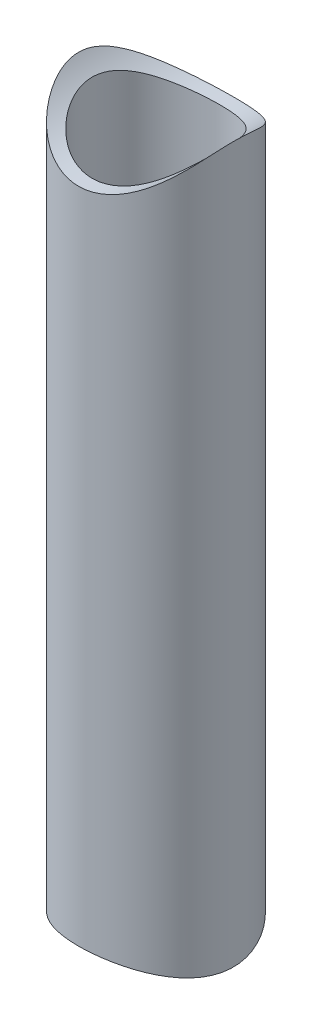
ISO-10303-21;
HEADER;
FILE_DESCRIPTION(('STEP AP214'),'2;1');
FILE_NAME('part.step','',(''),(''),'','','');
FILE_SCHEMA(('AUTOMOTIVE_DESIGN { 1 0 10303 214 1 1 1 1 }'));
ENDSEC;
DATA;
#1=APPLICATION_CONTEXT('core data for automotive mechanical design processes');
#2=APPLICATION_PROTOCOL_DEFINITION('international standard','automotive_design',2000,#1);
#3=PRODUCT_CONTEXT('',#1,'mechanical');
#4=PRODUCT('Part','Part','',(#3));
#5=PRODUCT_RELATED_PRODUCT_CATEGORY('part','',(#4));
#6=PRODUCT_DEFINITION_FORMATION('','',#4);
#7=PRODUCT_DEFINITION_CONTEXT('part definition',#1,'design');
#8=PRODUCT_DEFINITION('design','',#6,#7);
#9=PRODUCT_DEFINITION_SHAPE('','',#8);
#10=(LENGTH_UNIT() NAMED_UNIT(*) SI_UNIT(.MILLI.,.METRE.));
#11=(NAMED_UNIT(*) PLANE_ANGLE_UNIT() SI_UNIT($,.RADIAN.));
#12=(NAMED_UNIT(*) SI_UNIT($,.STERADIAN.) SOLID_ANGLE_UNIT());
#13=UNCERTAINTY_MEASURE_WITH_UNIT(LENGTH_MEASURE(1.E-05),#10,'distance_accuracy_value','');
#14=(GEOMETRIC_REPRESENTATION_CONTEXT(3) GLOBAL_UNCERTAINTY_ASSIGNED_CONTEXT((#13)) GLOBAL_UNIT_ASSIGNED_CONTEXT((#10,
#11,#12)) REPRESENTATION_CONTEXT('',''));
#15=CARTESIAN_POINT('',(0.,0.,0.));
#16=DIRECTION('',(0.,0.,1.));
#17=DIRECTION('',(1.,0.,0.));
#18=AXIS2_PLACEMENT_3D('',#15,#16,#17);
#19=CARTESIAN_POINT('',(0.,-152.4,0.));
#20=DIRECTION('',(0.,1.,0.));
#21=DIRECTION('',(0.,0.,1.));
#22=AXIS2_PLACEMENT_3D('',#19,#20,#21);
#23=CYLINDRICAL_SURFACE('',#22,12.7);
#24=CARTESIAN_POINT('',(0.,-123.825,12.7));
#25=CARTESIAN_POINT('',(-0.338275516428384,-123.825002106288,12.6999974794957));
#26=CARTESIAN_POINT('',(-0.676637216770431,-123.831022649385,12.6864669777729));
#27=CARTESIAN_POINT('',(-1.3509250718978,-123.854955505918,12.6324783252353));
#28=CARTESIAN_POINT('',(-1.68684972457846,-123.872874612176,12.5920047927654));
#29=CARTESIAN_POINT('',(-2.35434059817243,-123.920184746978,12.484453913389));
#30=CARTESIAN_POINT('',(-2.68589590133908,-123.949600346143,12.4173195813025));
#31=CARTESIAN_POINT('',(-3.34148510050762,-124.019130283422,12.2571749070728));
#32=CARTESIAN_POINT('',(-3.66552002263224,-124.059243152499,12.1641681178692));
#33=CARTESIAN_POINT('',(-4.30282306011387,-124.148990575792,11.9535745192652));
#34=CARTESIAN_POINT('',(-4.61612547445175,-124.198590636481,11.8360766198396));
#35=CARTESIAN_POINT('',(-5.23127441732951,-124.306194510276,11.5773536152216));
#36=CARTESIAN_POINT('',(-5.53312058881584,-124.364198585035,11.4361277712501));
#37=CARTESIAN_POINT('',(-6.12351543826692,-124.487205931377,11.1311679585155));
#38=CARTESIAN_POINT('',(-6.41207078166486,-124.552205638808,10.9674454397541));
#39=CARTESIAN_POINT('',(-6.97467687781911,-124.687759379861,10.6185450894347));
#40=CARTESIAN_POINT('',(-7.24872188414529,-124.758315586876,10.4333588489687));
#41=CARTESIAN_POINT('',(-7.79434869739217,-124.907042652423,10.032864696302));
#42=CARTESIAN_POINT('',(-8.06510430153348,-124.985418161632,9.8165068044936));
#43=CARTESIAN_POINT('',(-8.58765375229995,-125.144588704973,9.36279582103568));
#44=CARTESIAN_POINT('',(-8.83944677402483,-125.225383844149,9.12544181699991));
#45=CARTESIAN_POINT('',(-9.322896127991,-125.387423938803,8.63094577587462));
#46=CARTESIAN_POINT('',(-9.55454267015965,-125.46866909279,8.37379423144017));
#47=CARTESIAN_POINT('',(-9.99634947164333,-125.629514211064,7.84109449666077));
#48=CARTESIAN_POINT('',(-10.2065060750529,-125.70911389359,7.56554318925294));
#49=CARTESIAN_POINT('',(-10.6155907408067,-125.869058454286,6.98095767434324));
#50=CARTESIAN_POINT('',(-10.8131595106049,-125.949178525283,6.67090836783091));
#51=CARTESIAN_POINT('',(-11.1812213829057,-126.10264890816,6.03370532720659));
#52=CARTESIAN_POINT('',(-11.3517257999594,-126.176002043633,5.70655881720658));
#53=CARTESIAN_POINT('',(-11.6642112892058,-126.313490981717,5.03712025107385));
#54=CARTESIAN_POINT('',(-11.8061986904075,-126.37762882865,4.69483157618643));
#55=CARTESIAN_POINT('',(-12.0602022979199,-126.494369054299,3.99740081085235));
#56=CARTESIAN_POINT('',(-12.1722210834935,-126.546972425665,3.64225982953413));
#57=CARTESIAN_POINT('',(-12.3598745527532,-126.636181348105,2.94079929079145));
#58=CARTESIAN_POINT('',(-12.4371121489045,-126.673482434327,2.59499720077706));
#59=CARTESIAN_POINT('',(-12.5625324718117,-126.734492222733,1.8969699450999));
#60=CARTESIAN_POINT('',(-12.6107162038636,-126.758201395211,1.54474500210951));
#61=CARTESIAN_POINT('',(-12.6773679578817,-126.791088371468,0.837018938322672));
#62=CARTESIAN_POINT('',(-12.6958529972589,-126.800274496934,0.481519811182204));
#63=CARTESIAN_POINT('',(-12.7029000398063,-126.803770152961,-0.229837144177));
#64=CARTESIAN_POINT('',(-12.691463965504,-126.798080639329,-0.585694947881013));
#65=CARTESIAN_POINT('',(-12.6412011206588,-126.773230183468,-1.26284174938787));
#66=CARTESIAN_POINT('',(-12.6049216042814,-126.755322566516,-1.58437000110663));
#67=CARTESIAN_POINT('',(-12.508121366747,-126.707969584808,-2.22286951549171));
#68=CARTESIAN_POINT('',(-12.447602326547,-126.678525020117,-2.53984109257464));
#69=CARTESIAN_POINT('',(-12.3029467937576,-126.609021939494,-3.16720001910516));
#70=CARTESIAN_POINT('',(-12.2188063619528,-126.568961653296,-3.47758626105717));
#71=CARTESIAN_POINT('',(-12.0277145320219,-126.479432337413,-4.08985878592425));
#72=CARTESIAN_POINT('',(-11.920762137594,-126.429962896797,-4.3917446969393));
#73=CARTESIAN_POINT('',(-11.6823386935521,-126.321827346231,-4.99194762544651));
#74=CARTESIAN_POINT('',(-11.5503761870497,-126.262981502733,-5.29003675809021));
#75=CARTESIAN_POINT('',(-11.2645427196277,-126.138526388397,-5.87416833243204));
#76=CARTESIAN_POINT('',(-11.1106638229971,-126.072914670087,-6.16020636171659));
#77=CARTESIAN_POINT('',(-10.7820435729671,-125.936632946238,-6.71882166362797));
#78=CARTESIAN_POINT('',(-10.607299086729,-125.865962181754,-6.99139690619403));
#79=CARTESIAN_POINT('',(-10.2379852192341,-125.721289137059,-7.52184264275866));
#80=CARTESIAN_POINT('',(-10.0434145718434,-125.647286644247,-7.77971219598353));
#81=CARTESIAN_POINT('',(-9.61551258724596,-125.490347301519,-8.30405524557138));
#82=CARTESIAN_POINT('',(-9.380251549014,-125.407244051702,-8.56890706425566));
#83=CARTESIAN_POINT('',(-8.88849312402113,-125.241343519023,-9.07798977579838));
#84=CARTESIAN_POINT('',(-8.63200376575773,-125.158546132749,-9.32222839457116));
#85=CARTESIAN_POINT('',(-8.09888464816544,-124.995320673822,-9.78895610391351));
#86=CARTESIAN_POINT('',(-7.82224043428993,-124.914894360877,-10.0114293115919));
#87=CARTESIAN_POINT('',(-7.25057211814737,-124.758589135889,-10.4328931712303));
#88=CARTESIAN_POINT('',(-6.95555553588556,-124.682708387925,-10.6318933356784));
#89=CARTESIAN_POINT('',(-6.33960061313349,-124.535267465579,-11.010632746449));
#90=CARTESIAN_POINT('',(-6.01815123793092,-124.463904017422,-11.189619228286));
#91=CARTESIAN_POINT('',(-5.35940892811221,-124.330081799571,-11.5196547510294));
#92=CARTESIAN_POINT('',(-5.02211549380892,-124.267623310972,-11.670702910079));
#93=CARTESIAN_POINT('',(-4.33421963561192,-124.153466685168,-11.9432546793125));
#94=CARTESIAN_POINT('',(-3.98362407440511,-124.101763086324,-12.0647732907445));
#95=CARTESIAN_POINT('',(-3.27167046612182,-124.010643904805,-12.2769748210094));
#96=CARTESIAN_POINT('',(-2.91031336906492,-123.971227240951,-12.3676604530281));
#97=CARTESIAN_POINT('',(-2.20542331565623,-123.908193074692,-12.5118474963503));
#98=CARTESIAN_POINT('',(-1.86241214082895,-123.883663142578,-12.5675065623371));
#99=CARTESIAN_POINT('',(-1.17232915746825,-123.846968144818,-12.6505493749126));
#100=CARTESIAN_POINT('',(-0.825257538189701,-123.834802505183,-12.6779344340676));
#101=CARTESIAN_POINT('',(-0.129927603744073,-123.823180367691,-12.704099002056));
#102=CARTESIAN_POINT('',(0.218330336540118,-123.823720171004,-12.7028868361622));
#103=CARTESIAN_POINT('',(0.913314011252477,-123.83748494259,-12.6718916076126));
#104=CARTESIAN_POINT('',(1.26003978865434,-123.850709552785,-12.6421093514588));
#105=CARTESIAN_POINT('',(1.92911930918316,-123.88833915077,-12.5568920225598));
#106=CARTESIAN_POINT('',(2.25171701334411,-123.912048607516,-12.5030509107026));
#107=CARTESIAN_POINT('',(2.89089854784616,-123.969799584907,-12.3709014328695));
#108=CARTESIAN_POINT('',(3.2074826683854,-124.003840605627,-12.2925942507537));
#109=CARTESIAN_POINT('',(3.83263444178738,-124.081441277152,-12.1122567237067));
#110=CARTESIAN_POINT('',(4.14120155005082,-124.125001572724,-12.010224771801));
#111=CARTESIAN_POINT('',(4.74846725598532,-124.220624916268,-11.7833413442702));
#112=CARTESIAN_POINT('',(5.04716547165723,-124.272688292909,-11.6584889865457));
#113=CARTESIAN_POINT('',(5.64212359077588,-124.385868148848,-11.3827609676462));
#114=CARTESIAN_POINT('',(5.93802141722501,-124.447215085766,-11.2311990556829));
#115=CARTESIAN_POINT('',(6.51608995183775,-124.576287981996,-10.9059893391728));
#116=CARTESIAN_POINT('',(6.79825565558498,-124.644016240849,-10.7323335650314));
#117=CARTESIAN_POINT('',(7.3474129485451,-124.784307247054,-10.3641130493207));
#118=CARTESIAN_POINT('',(7.61440114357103,-124.856871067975,-10.1695436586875));
#119=CARTESIAN_POINT('',(8.13186805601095,-125.005186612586,-9.76070988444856));
#120=CARTESIAN_POINT('',(8.38234738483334,-125.080938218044,-9.54644623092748));
#121=CARTESIAN_POINT('',(8.88518024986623,-125.240117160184,-9.0813070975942));
#122=CARTESIAN_POINT('',(9.13605373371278,-125.323670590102,-8.8288724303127));
#123=CARTESIAN_POINT('',(9.61582285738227,-125.490316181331,-8.30376088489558));
#124=CARTESIAN_POINT('',(9.84471746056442,-125.573408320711,-8.03108305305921));
#125=CARTESIAN_POINT('',(10.2792401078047,-125.736883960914,-7.46686299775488));
#126=CARTESIAN_POINT('',(10.4848609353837,-125.817266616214,-7.17531496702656));
#127=CARTESIAN_POINT('',(10.8714099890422,-125.972996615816,-6.57494656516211));
#128=CARTESIAN_POINT('',(11.0523353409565,-126.048343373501,-6.26612418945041));
#129=CARTESIAN_POINT('',(11.3920791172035,-126.193395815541,-5.62539933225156));
#130=CARTESIAN_POINT('',(11.5502686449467,-126.262924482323,-5.29312240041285));
#131=CARTESIAN_POINT('',(11.8377196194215,-126.391850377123,-4.61455164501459));
#132=CARTESIAN_POINT('',(11.9669946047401,-126.451252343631,-4.2682644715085));
#133=CARTESIAN_POINT('',(12.1952202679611,-126.557726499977,-3.56419188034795));
#134=CARTESIAN_POINT('',(12.2941882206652,-126.604805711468,-3.20641314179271));
#135=CARTESIAN_POINT('',(12.4606355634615,-126.684795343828,-2.48205760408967));
#136=CARTESIAN_POINT('',(12.5281185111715,-126.717707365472,-2.11548180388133));
#137=CARTESIAN_POINT('',(12.6263100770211,-126.765850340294,-1.40811261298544));
#138=CARTESIAN_POINT('',(12.6596516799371,-126.78234387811,-1.06776863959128));
#139=CARTESIAN_POINT('',(12.6987614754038,-126.801707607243,-0.385118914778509));
#140=CARTESIAN_POINT('',(12.7045312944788,-126.804578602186,-0.0428132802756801));
#141=CARTESIAN_POINT('',(12.6884258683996,-126.796591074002,0.640915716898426));
#142=CARTESIAN_POINT('',(12.6665558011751,-126.785735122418,0.982339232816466));
#143=CARTESIAN_POINT('',(12.5954601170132,-126.750700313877,1.66162592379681));
#144=CARTESIAN_POINT('',(12.5462349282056,-126.72652166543,1.99948915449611));
#145=CARTESIAN_POINT('',(12.4248256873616,-126.667557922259,2.64879578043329));
#146=CARTESIAN_POINT('',(12.3542103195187,-126.633502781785,2.96060116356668));
#147=CARTESIAN_POINT('',(12.1900455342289,-126.555432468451,3.57694459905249));
#148=CARTESIAN_POINT('',(12.0964882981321,-126.511413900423,3.88148013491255));
#149=CARTESIAN_POINT('',(11.887291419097,-126.414692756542,4.48143266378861));
#150=CARTESIAN_POINT('',(11.771651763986,-126.361990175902,4.77684965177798));
#151=CARTESIAN_POINT('',(11.5191985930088,-126.249325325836,5.35706813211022));
#152=CARTESIAN_POINT('',(11.382383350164,-126.189362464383,5.64186875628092));
#153=CARTESIAN_POINT('',(11.0791108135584,-126.05967290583,6.21737604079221));
#154=CARTESIAN_POINT('',(10.9113162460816,-125.989566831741,6.50729268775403));
#155=CARTESIAN_POINT('',(10.5539646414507,-125.844744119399,7.07216666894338));
#156=CARTESIAN_POINT('',(10.3644069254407,-125.77002733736,7.34712353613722));
#157=CARTESIAN_POINT('',(9.96458916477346,-125.617854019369,7.88087429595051));
#158=CARTESIAN_POINT('',(9.75432293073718,-125.540396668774,8.13966331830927));
#159=CARTESIAN_POINT('',(9.31422118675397,-125.384626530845,8.63980703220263));
#160=CARTESIAN_POINT('',(9.08438294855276,-125.306313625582,8.88115928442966));
#161=CARTESIAN_POINT('',(8.5852807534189,-125.143838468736,9.36558938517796));
#162=CARTESIAN_POINT('',(8.31432695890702,-125.059765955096,9.60696020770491));
#163=CARTESIAN_POINT('',(7.75222207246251,-124.895102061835,10.0660162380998));
#164=CARTESIAN_POINT('',(7.46107797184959,-124.81450949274,10.2837095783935));
#165=CARTESIAN_POINT('',(6.85992532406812,-124.658902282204,10.6941088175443));
#166=CARTESIAN_POINT('',(6.54990307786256,-124.583891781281,10.8867962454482));
#167=CARTESIAN_POINT('',(5.91306841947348,-124.441590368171,11.2454052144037));
#168=CARTESIAN_POINT('',(5.5862572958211,-124.374298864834,11.4113288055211));
#169=CARTESIAN_POINT('',(4.92173118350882,-124.250041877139,11.7131646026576));
#170=CARTESIAN_POINT('',(4.58418075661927,-124.192968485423,11.8493942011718));
#171=CARTESIAN_POINT('',(3.89704116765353,-124.089853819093,12.0928044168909));
#172=CARTESIAN_POINT('',(3.54745011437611,-124.043814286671,12.1999804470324));
#173=CARTESIAN_POINT('',(2.83996412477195,-123.964254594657,12.38377313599));
#174=CARTESIAN_POINT('',(2.48209445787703,-123.930700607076,12.4604724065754));
#175=CARTESIAN_POINT('',(1.76026492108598,-123.876976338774,12.5827379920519));
#176=CARTESIAN_POINT('',(1.39630946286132,-123.856796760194,12.6283259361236));
#177=CARTESIAN_POINT('',(0.859545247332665,-123.83741437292,12.6720476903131));
#178=CARTESIAN_POINT('',(0.687846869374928,-123.832762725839,12.6825256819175));
#179=CARTESIAN_POINT('',(0.344106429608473,-123.826554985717,12.6965025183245));
#180=CARTESIAN_POINT('',(0.172064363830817,-123.824998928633,12.7000012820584));
#181=CARTESIAN_POINT('',(0.,-123.825,12.7));
#182=B_SPLINE_CURVE_WITH_KNOTS('',3,(#24,#25,#26,#27,#28,#29,#30,#31,#32,#33,#34,#35,#36,#37,
#38,#39,#40,#41,#42,#43,#44,#45,#46,#47,#48,#49,#50,#51,#52,#53,#54,#55,#56,#57,#58,#59,#60,#61,
#62,#63,#64,#65,#66,#67,#68,#69,#70,#71,#72,#73,#74,#75,#76,#77,#78,#79,#80,#81,#82,#83,#84,#85,
#86,#87,#88,#89,#90,#91,#92,#93,#94,#95,#96,#97,#98,#99,#100,#101,#102,#103,#104,#105,#106,#107,
#108,#109,#110,#111,#112,#113,#114,#115,#116,#117,#118,#119,#120,#121,#122,#123,#124,#125,#126,
#127,#128,#129,#130,#131,#132,#133,#134,#135,#136,#137,#138,#139,#140,#141,#142,#143,#144,#145,
#146,#147,#148,#149,#150,#151,#152,#153,#154,#155,#156,#157,#158,#159,#160,#161,#162,#163,#164,
#165,#166,#167,#168,#169,#170,#171,#172,#173,#174,#175,#176,#177,#178,#179,#180,#181),
.UNSPECIFIED.,.T.,.F.,(4,2,2,2,2,2,2,2,2,2,2,2,2,2,2,2,2,2,2,2,2,2,2,2,2,2,2,2,2,2,2,2,2,2,2,2,
2,2,2,2,2,2,2,2,2,2,2,2,2,2,2,2,2,2,2,2,2,2,2,2,2,2,2,2,2,2,2,2,2,2,2,2,2,2,2,2,2,2,4),(0.,
1.0146537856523,2.02988732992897,3.04730263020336,4.06457828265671,5.07822331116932,
6.09189990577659,7.10506247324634,8.11862332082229,9.18346736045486,10.2483576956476,
11.3137626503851,12.3793485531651,13.5067704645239,14.6337197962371,15.760418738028,
16.8870206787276,17.9544074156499,19.0217572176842,20.0884952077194,21.1551646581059,
22.1262157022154,23.0971994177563,24.0683451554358,25.0395333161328,26.0322746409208,
27.0253763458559,28.0186273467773,29.0119418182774,30.1023231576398,31.1922939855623,
32.283054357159,33.3733711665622,34.4962518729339,35.6191680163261,36.7415125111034,
37.8637582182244,38.9074871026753,39.951167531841,40.9945441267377,42.0378912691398,
43.020512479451,44.0030861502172,44.9857263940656,45.9684046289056,46.9815196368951,
47.9950011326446,49.0087083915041,50.0223780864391,51.1178524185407,52.2133783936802,
53.3092431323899,54.4052353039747,55.5273216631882,56.6488815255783,57.7698009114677,
58.8905936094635,59.9163521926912,60.942050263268,61.9675562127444,62.9930461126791,
63.9565117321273,64.920306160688,65.884101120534,66.8479747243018,67.8735821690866,
68.8992216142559,69.9251685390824,70.9512587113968,72.0673887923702,73.1831343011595,
74.299699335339,75.4161788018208,76.52006540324,77.6241261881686,78.7251734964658,
79.8254545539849,80.3415537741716,80.8576589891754),.UNSPECIFIED.);
#183=CARTESIAN_POINT('',(0.,-123.825,12.7));
#184=VERTEX_POINT('',#183);
#185=EDGE_CURVE('E52',#184,#184,#182,.T.);
#186=ORIENTED_EDGE('',*,*,#185,.F.);
#187=EDGE_LOOP('',(#186));
#188=FACE_BOUND('',#187,.T.);
#189=CARTESIAN_POINT('',(0.,-15.875,12.7));
#190=CARTESIAN_POINT('',(0.30494667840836,-15.874997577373,12.6999975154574));
#191=CARTESIAN_POINT('',(0.609940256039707,-15.8661933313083,12.6889969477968));
#192=CARTESIAN_POINT('',(1.21747713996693,-15.8311732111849,12.6451804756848));
#193=CARTESIAN_POINT('',(1.5200190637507,-15.8049481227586,12.612353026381));
#194=CARTESIAN_POINT('',(2.12065102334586,-15.7356292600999,12.5253780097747));
#195=CARTESIAN_POINT('',(2.41873141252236,-15.6925032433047,12.4711896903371));
#196=CARTESIAN_POINT('',(3.00760934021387,-15.590356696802,12.3424119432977));
#197=CARTESIAN_POINT('',(3.29840768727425,-15.5313379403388,12.2678247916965));
#198=CARTESIAN_POINT('',(3.86906959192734,-15.3990641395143,12.099925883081));
#199=CARTESIAN_POINT('',(4.14899129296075,-15.3259027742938,12.006737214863));
#200=CARTESIAN_POINT('',(4.69839855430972,-15.1664928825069,11.8025822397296));
#201=CARTESIAN_POINT('',(4.96788404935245,-15.0802442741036,11.6916158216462));
#202=CARTESIAN_POINT('',(5.49524841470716,-14.896169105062,11.4532077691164));
#203=CARTESIAN_POINT('',(5.75313016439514,-14.7983454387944,11.3257702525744));
#204=CARTESIAN_POINT('',(6.25659857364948,-14.5926211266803,11.0556152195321));
#205=CARTESIAN_POINT('',(6.50218270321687,-14.4847184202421,10.9128945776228));
#206=CARTESIAN_POINT('',(7.06379319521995,-14.2212954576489,10.5611350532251));
#207=CARTESIAN_POINT('',(7.37457237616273,-14.0622771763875,10.3463079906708));
#208=CARTESIAN_POINT('',(7.97197358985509,-13.7324350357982,9.89334435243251));
#209=CARTESIAN_POINT('',(8.25858785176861,-13.5616074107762,9.65520033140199));
#210=CARTESIAN_POINT('',(8.80794766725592,-13.2114362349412,9.15685342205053));
#211=CARTESIAN_POINT('',(9.07062785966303,-13.0320712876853,8.89659367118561));
#212=CARTESIAN_POINT('',(9.57101847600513,-12.6691256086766,8.35591402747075));
#213=CARTESIAN_POINT('',(9.80873173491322,-12.4855453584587,8.07549642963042));
#214=CARTESIAN_POINT('',(10.2625205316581,-12.1154170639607,7.49064843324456));
#215=CARTESIAN_POINT('',(10.4781992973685,-11.9288675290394,7.18591095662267));
#216=CARTESIAN_POINT('',(10.8831695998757,-11.5605858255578,6.55642941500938));
#217=CARTESIAN_POINT('',(11.07245279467,-11.3788551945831,6.23167907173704));
#218=CARTESIAN_POINT('',(11.4230949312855,-11.0267876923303,5.56282532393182));
#219=CARTESIAN_POINT('',(11.584529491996,-10.8564207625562,5.21877779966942));
#220=CARTESIAN_POINT('',(11.8782406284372,-10.5342528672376,4.5104779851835));
#221=CARTESIAN_POINT('',(12.010542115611,-10.3824360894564,4.14624329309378));
#222=CARTESIAN_POINT('',(12.2609502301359,-10.0860255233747,3.34094195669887));
#223=CARTESIAN_POINT('',(12.3739822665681,-9.94590029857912,2.89652698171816));
#224=CARTESIAN_POINT('',(12.5077685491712,-9.77632497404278,2.2134929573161));
#225=CARTESIAN_POINT('',(12.5463874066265,-9.72659169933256,1.98326628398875));
#226=CARTESIAN_POINT('',(12.6111097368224,-9.64252902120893,1.51821018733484));
#227=CARTESIAN_POINT('',(12.6372133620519,-9.60819943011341,1.28338082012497));
#228=CARTESIAN_POINT('',(12.6764877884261,-9.55632598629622,0.808636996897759));
#229=CARTESIAN_POINT('',(12.6895407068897,-9.53893517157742,0.568695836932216));
#230=CARTESIAN_POINT('',(12.701973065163,-9.5223745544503,0.0878316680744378));
#231=CARTESIAN_POINT('',(12.701353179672,-9.52320385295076,-0.153091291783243));
#232=CARTESIAN_POINT('',(12.6864510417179,-9.54304635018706,-0.633926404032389));
#233=CARTESIAN_POINT('',(12.6721588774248,-9.56207274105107,-0.873837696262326));
#234=CARTESIAN_POINT('',(12.6302598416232,-9.61734609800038,-1.35048399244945));
#235=CARTESIAN_POINT('',(12.6026511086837,-9.65359547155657,-1.58721854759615));
#236=CARTESIAN_POINT('',(12.5294118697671,-9.74851742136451,-2.09256134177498));
#237=CARTESIAN_POINT('',(12.4816382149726,-9.80981014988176,-2.36036441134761));
#238=CARTESIAN_POINT('',(12.3702320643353,-9.94992273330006,-2.88792518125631));
#239=CARTESIAN_POINT('',(12.3065961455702,-10.0287463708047,-3.14768113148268));
#240=CARTESIAN_POINT('',(12.1644148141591,-10.2007400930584,-3.65890561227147));
#241=CARTESIAN_POINT('',(12.0858329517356,-10.2939451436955,-3.91035208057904));
#242=CARTESIAN_POINT('',(11.9148315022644,-10.4914007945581,-4.40397926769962));
#243=CARTESIAN_POINT('',(11.8224108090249,-10.5956522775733,-4.64615924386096));
#244=CARTESIAN_POINT('',(11.5758866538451,-10.8656452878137,-5.23795352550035));
#245=CARTESIAN_POINT('',(11.4137761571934,-11.036447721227,-5.58194057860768));
#246=CARTESIAN_POINT('',(11.0621800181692,-11.3888481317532,-6.24985531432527));
#247=CARTESIAN_POINT('',(10.8726817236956,-11.5704510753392,-6.57377362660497));
#248=CARTESIAN_POINT('',(10.4670632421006,-11.938648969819,-7.20212144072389));
#249=CARTESIAN_POINT('',(10.2509122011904,-12.1252495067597,-7.50652772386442));
#250=CARTESIAN_POINT('',(9.79269564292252,-12.4982409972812,-8.09519604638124));
#251=CARTESIAN_POINT('',(9.55063438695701,-12.6846319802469,-8.37946138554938));
#252=CARTESIAN_POINT('',(9.03396923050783,-13.0578441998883,-8.93448120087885));
#253=CARTESIAN_POINT('',(8.75866725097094,-13.2445431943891,-9.20466971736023));
#254=CARTESIAN_POINT('',(8.18114501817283,-13.6088599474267,-9.72157555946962));
#255=CARTESIAN_POINT('',(7.87892080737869,-13.7864763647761,-9.96828942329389));
#256=CARTESIAN_POINT('',(7.24878360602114,-14.127947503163,-10.4354494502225));
#257=CARTESIAN_POINT('',(6.92093102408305,-14.2918328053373,-10.6559544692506));
#258=CARTESIAN_POINT('',(6.23998049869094,-14.6019884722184,-11.0684651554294));
#259=CARTESIAN_POINT('',(5.88689405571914,-14.7482667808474,-11.2604836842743));
#260=CARTESIAN_POINT('',(5.26225278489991,-14.9800275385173,-11.5620941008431));
#261=CARTESIAN_POINT('',(4.99644491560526,-15.0708975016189,-11.6795115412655));
#262=CARTESIAN_POINT('',(4.45395465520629,-15.2400320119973,-11.8969586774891));
#263=CARTESIAN_POINT('',(4.17727498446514,-15.3182996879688,-11.9969926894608));
#264=CARTESIAN_POINT('',(3.61447195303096,-15.4607707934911,-12.1783807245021));
#265=CARTESIAN_POINT('',(3.3283533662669,-15.5249812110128,-12.2597440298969));
#266=CARTESIAN_POINT('',(2.7482188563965,-15.6381022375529,-12.4026822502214));
#267=CARTESIAN_POINT('',(2.45420272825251,-15.6870124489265,-12.4642566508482));
#268=CARTESIAN_POINT('',(1.85875128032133,-15.7686854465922,-12.5668925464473));
#269=CARTESIAN_POINT('',(1.55728497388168,-15.8013615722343,-12.6078439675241));
#270=CARTESIAN_POINT('',(0.95081240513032,-15.849419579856,-12.6680229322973));
#271=CARTESIAN_POINT('',(0.645806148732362,-15.8648014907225,-12.6872505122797));
#272=CARTESIAN_POINT('',(0.0348642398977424,-15.8779014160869,-12.7036275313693));
#273=CARTESIAN_POINT('',(-0.271071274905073,-15.8756219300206,-12.7007800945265));
#274=CARTESIAN_POINT('',(-0.881287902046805,-15.8534588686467,-12.6730660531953));
#275=CARTESIAN_POINT('',(-1.1855690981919,-15.8335761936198,-12.6482005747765));
#276=CARTESIAN_POINT('',(-1.76540064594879,-15.778998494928,-12.5798073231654));
#277=CARTESIAN_POINT('',(-2.04127806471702,-15.7456369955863,-12.5379584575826));
#278=CARTESIAN_POINT('',(-2.58771032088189,-15.665109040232,-12.4366780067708));
#279=CARTESIAN_POINT('',(-2.85826550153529,-15.6179434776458,-12.3772475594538));
#280=CARTESIAN_POINT('',(-3.39254641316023,-15.5106583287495,-12.2415938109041));
#281=CARTESIAN_POINT('',(-3.6562707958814,-15.450536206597,-12.1653672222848));
#282=CARTESIAN_POINT('',(-4.17553455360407,-15.3183657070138,-11.9970586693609));
#283=CARTESIAN_POINT('',(-4.43107347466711,-15.2463166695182,-11.9049758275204));
#284=CARTESIAN_POINT('',(-4.94835701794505,-15.0866529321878,-11.6998236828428));
#285=CARTESIAN_POINT('',(-5.20951546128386,-14.9983531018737,-11.5858114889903));
#286=CARTESIAN_POINT('',(-5.72055257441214,-14.8109761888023,-11.3421978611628));
#287=CARTESIAN_POINT('',(-5.9704266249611,-14.7118947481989,-11.212590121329));
#288=CARTESIAN_POINT('',(-6.45802479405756,-14.5044721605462,-10.9390146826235));
#289=CARTESIAN_POINT('',(-6.69575310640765,-14.3961342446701,-10.7950519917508));
#290=CARTESIAN_POINT('',(-7.15871987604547,-14.1716111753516,-10.4937614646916));
#291=CARTESIAN_POINT('',(-7.38395661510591,-14.0554249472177,-10.3364317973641));
#292=CARTESIAN_POINT('',(-7.86303164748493,-13.794064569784,-9.97839088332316));
#293=CARTESIAN_POINT('',(-8.11422305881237,-13.647563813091,-9.77510245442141));
#294=CARTESIAN_POINT('',(-8.5982311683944,-13.3479242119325,-9.3522045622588));
#295=CARTESIAN_POINT('',(-8.83104576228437,-13.1947846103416,-9.1325932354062));
#296=CARTESIAN_POINT('',(-9.27874690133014,-12.8839022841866,-8.67738740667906));
#297=CARTESIAN_POINT('',(-9.49358271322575,-12.7261481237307,-8.44175086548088));
#298=CARTESIAN_POINT('',(-9.90448653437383,-12.4090345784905,-7.95565470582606));
#299=CARTESIAN_POINT('',(-10.1005531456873,-12.249675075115,-7.70519398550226));
#300=CARTESIAN_POINT('',(-10.5135528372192,-11.8982821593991,-7.13472744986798));
#301=CARTESIAN_POINT('',(-10.7260095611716,-11.7065335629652,-6.81128686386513));
#302=CARTESIAN_POINT('',(-11.1223556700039,-11.3306415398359,-6.14282201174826));
#303=CARTESIAN_POINT('',(-11.3062299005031,-11.1465021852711,-5.79778643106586));
#304=CARTESIAN_POINT('',(-11.6432760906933,-10.7939325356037,-5.08707352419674));
#305=CARTESIAN_POINT('',(-11.7965539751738,-10.625449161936,-4.72147323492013));
#306=CARTESIAN_POINT('',(-12.070692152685,-10.3129620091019,-3.96843833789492));
#307=CARTESIAN_POINT('',(-12.1915924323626,-10.1689281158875,-3.58103138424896));
#308=CARTESIAN_POINT('',(-12.3499941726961,-9.97501858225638,-2.96927076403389));
#309=CARTESIAN_POINT('',(-12.4002315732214,-9.91236969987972,-2.75219951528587));
#310=CARTESIAN_POINT('',(-12.4896683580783,-9.79943847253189,-2.31266785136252));
#311=CARTESIAN_POINT('',(-12.5288722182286,-9.74915111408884,-2.09020966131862));
#312=CARTESIAN_POINT('',(-12.5955394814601,-9.6628667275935,-1.64126953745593));
#313=CARTESIAN_POINT('',(-12.6230273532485,-9.62683992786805,-1.41479702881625));
#314=CARTESIAN_POINT('',(-12.6658301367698,-9.57045641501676,-0.958741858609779));
#315=CARTESIAN_POINT('',(-12.6811451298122,-9.55009959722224,-0.72915921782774));
#316=CARTESIAN_POINT('',(-12.6992991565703,-9.52594684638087,-0.267359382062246));
#317=CARTESIAN_POINT('',(-12.7020696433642,-9.52224190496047,-0.0351346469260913));
#318=CARTESIAN_POINT('',(-12.6948802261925,-9.53182425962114,0.428755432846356));
#319=CARTESIAN_POINT('',(-12.6849205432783,-9.54511126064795,0.660420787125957));
#320=CARTESIAN_POINT('',(-12.6524873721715,-9.58806046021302,1.12164549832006));
#321=CARTESIAN_POINT('',(-12.6299967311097,-9.61774510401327,1.35120152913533));
#322=CARTESIAN_POINT('',(-12.5729788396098,-9.69216225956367,1.80633269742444));
#323=CARTESIAN_POINT('',(-12.5384497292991,-9.73689709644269,2.03190721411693));
#324=CARTESIAN_POINT('',(-12.4469453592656,-9.85373460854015,2.53907564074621));
#325=CARTESIAN_POINT('',(-12.3864116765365,-9.92997795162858,2.81907430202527));
#326=CARTESIAN_POINT('',(-12.2481923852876,-10.0999691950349,3.36932474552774));
#327=CARTESIAN_POINT('',(-12.1705011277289,-10.1937228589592,3.63957328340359));
#328=CARTESIAN_POINT('',(-11.9990053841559,-10.3950472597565,4.17035344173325));
#329=CARTESIAN_POINT('',(-11.9051624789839,-10.5026507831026,4.43086004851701));
#330=CARTESIAN_POINT('',(-11.702490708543,-10.7280159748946,4.94137079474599));
#331=CARTESIAN_POINT('',(-11.593661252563,-10.8457780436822,5.19137451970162));
#332=CARTESIAN_POINT('',(-11.3090850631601,-11.1435931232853,5.79222146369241));
#333=CARTESIAN_POINT('',(-11.1253860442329,-11.3276582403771,6.13732923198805));
#334=CARTESIAN_POINT('',(-10.7292417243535,-11.7035758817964,6.80621143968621));
#335=CARTESIAN_POINT('',(-10.5167847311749,-11.8954315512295,7.12997712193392));
#336=CARTESIAN_POINT('',(-10.0636628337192,-12.2811620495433,7.7564320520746));
#337=CARTESIAN_POINT('',(-9.82297127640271,-12.4750386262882,8.05910094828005));
#338=CARTESIAN_POINT('',(-9.31393241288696,-12.8595507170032,8.642363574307));
#339=CARTESIAN_POINT('',(-9.04558947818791,-13.0501867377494,8.92296078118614));
#340=CARTESIAN_POINT('',(-8.47769837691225,-13.4261593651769,9.46438292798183));
#341=CARTESIAN_POINT('',(-8.17778443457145,-13.6113925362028,9.72489728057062));
#342=CARTESIAN_POINT('',(-7.55007024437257,-13.9693450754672,10.2198911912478));
#343=CARTESIAN_POINT('',(-7.22226538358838,-14.1420623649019,10.454366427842));
#344=CARTESIAN_POINT('',(-6.54049083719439,-14.4699812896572,10.8938546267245));
#345=CARTESIAN_POINT('',(-6.18658633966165,-14.6252242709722,11.0989374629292));
#346=CARTESIAN_POINT('',(-5.4536636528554,-14.9140221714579,11.4768145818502));
#347=CARTESIAN_POINT('',(-5.07466102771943,-15.047590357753,11.649628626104));
#348=CARTESIAN_POINT('',(-4.42189355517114,-15.2492021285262,11.9086856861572));
#349=CARTESIAN_POINT('',(-4.15419225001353,-15.3243975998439,12.0047678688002));
#350=CARTESIAN_POINT('',(-3.60990702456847,-15.4616586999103,12.1794989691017));
#351=CARTESIAN_POINT('',(-3.33332548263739,-15.5237278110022,12.2581525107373));
#352=CARTESIAN_POINT('',(-2.77338166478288,-15.6334644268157,12.3968293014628));
#353=CARTESIAN_POINT('',(-2.49003537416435,-15.6811628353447,12.4568925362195));
#354=CARTESIAN_POINT('',(-1.91790207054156,-15.7613654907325,12.5577049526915));
#355=CARTESIAN_POINT('',(-1.62911753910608,-15.7938765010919,12.5984627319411));
#356=CARTESIAN_POINT('',(-1.11689347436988,-15.8372262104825,12.6527586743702));
#357=CARTESIAN_POINT('',(-0.894161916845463,-15.8513728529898,12.67045568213));
#358=CARTESIAN_POINT('',(-0.447628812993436,-15.870261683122,12.6940785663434));
#359=CARTESIAN_POINT('',(-0.223827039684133,-15.8750017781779,12.7000018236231));
#360=CARTESIAN_POINT('',(0.,-15.875,12.7));
#361=B_SPLINE_CURVE_WITH_KNOTS('',3,(#189,#190,#191,#192,#193,#194,#195,#196,#197,#198,#199,
#200,#201,#202,#203,#204,#205,#206,#207,#208,#209,#210,#211,#212,#213,#214,#215,#216,#217,#218,
#219,#220,#221,#222,#223,#224,#225,#226,#227,#228,#229,#230,#231,#232,#233,#234,#235,#236,#237,
#238,#239,#240,#241,#242,#243,#244,#245,#246,#247,#248,#249,#250,#251,#252,#253,#254,#255,#256,
#257,#258,#259,#260,#261,#262,#263,#264,#265,#266,#267,#268,#269,#270,#271,#272,#273,#274,#275,
#276,#277,#278,#279,#280,#281,#282,#283,#284,#285,#286,#287,#288,#289,#290,#291,#292,#293,#294,
#295,#296,#297,#298,#299,#300,#301,#302,#303,#304,#305,#306,#307,#308,#309,#310,#311,#312,#313,
#314,#315,#316,#317,#318,#319,#320,#321,#322,#323,#324,#325,#326,#327,#328,#329,#330,#331,#332,
#333,#334,#335,#336,#337,#338,#339,#340,#341,#342,#343,#344,#345,#346,#347,#348,#349,#350,#351,
#352,#353,#354,#355,#356,#357,#358,#359,#360),.UNSPECIFIED.,.T.,.F.,(4,2,2,2,2,2,2,2,2,2,2,2,2,
2,2,2,2,2,2,2,2,2,2,2,2,2,2,2,2,2,2,2,2,2,2,2,2,2,2,2,2,2,2,2,2,2,2,2,2,2,2,2,2,2,2,2,2,2,2,2,2,
2,2,2,2,2,2,2,2,2,2,2,2,2,2,2,2,2,2,2,2,2,2,2,2,4),(0.,0.914599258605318,1.82968265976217,
2.74652036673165,3.66325581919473,4.57411502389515,5.48497992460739,6.39561754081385,
7.30644173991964,8.53441267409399,9.76277699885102,10.9944011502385,12.2258853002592,
13.4766388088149,14.727786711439,15.9754819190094,17.2221060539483,18.6549958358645,
19.3703218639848,20.0856391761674,20.8073608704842,21.5290469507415,22.2512566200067,
22.9735672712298,23.8088380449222,24.6442892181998,25.4818046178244,26.3193869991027,
27.5681742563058,28.8175402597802,30.0683663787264,31.3189870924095,32.603111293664,
33.8874245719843,35.1687969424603,36.4495889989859,37.3621270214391,38.2744381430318,
39.1862947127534,40.0981749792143,41.0148720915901,41.931567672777,42.8481335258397,
43.7646525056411,44.6067670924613,45.4488271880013,46.2910522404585,47.133323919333,
48.0274392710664,48.921917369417,49.8160844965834,50.7103743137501,51.7737939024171,
52.8373350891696,53.9037827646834,54.9703098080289,56.2644417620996,57.5592575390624,
58.8495097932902,60.138161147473,60.8319627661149,61.525482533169,62.2175467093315,
62.9096062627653,63.6054429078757,64.30126747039,64.9980468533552,65.6949339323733,
66.5828642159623,67.4710872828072,68.3614530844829,69.2518539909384,70.5464038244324,
71.8414815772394,73.1377918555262,74.4338975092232,75.747145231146,77.0606105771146,
78.3708997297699,79.6803838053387,80.5621267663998,81.4436355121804,82.3232348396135,
83.202442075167,83.8735971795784,84.5449015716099),.UNSPECIFIED.);
#362=CARTESIAN_POINT('',(0.,-15.875,12.7));
#363=VERTEX_POINT('',#362);
#364=EDGE_CURVE('E10',#363,#363,#361,.T.);
#365=ORIENTED_EDGE('',*,*,#364,.F.);
#366=EDGE_LOOP('',(#365));
#367=FACE_BOUND('',#366,.T.);
#368=ADVANCED_FACE('F35',(#188,#367),#23,.T.);
#369=CARTESIAN_POINT('',(0.,-152.4,0.));
#370=DIRECTION('',(0.,1.,0.));
#371=DIRECTION('',(0.,0.,1.));
#372=AXIS2_PLACEMENT_3D('',#369,#370,#371);
#373=CYLINDRICAL_SURFACE('',#372,10.4648);
#374=CARTESIAN_POINT('',(0.,-123.825,10.4648));
#375=CARTESIAN_POINT('',(-0.28382445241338,-123.824999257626,10.4648010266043));
#376=CARTESIAN_POINT('',(-0.567634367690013,-123.829237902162,10.4532443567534));
#377=CARTESIAN_POINT('',(-1.13311584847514,-123.846074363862,10.4071392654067));
#378=CARTESIAN_POINT('',(-1.41478755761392,-123.858671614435,10.3725924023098));
#379=CARTESIAN_POINT('',(-1.97390214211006,-123.891882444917,10.2808561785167));
#380=CARTESIAN_POINT('',(-2.25134544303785,-123.912495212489,10.2236691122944));
#381=CARTESIAN_POINT('',(-2.80007248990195,-123.961186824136,10.0871982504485));
#382=CARTESIAN_POINT('',(-3.07135609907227,-123.98926583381,10.0079139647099));
#383=CARTESIAN_POINT('',(-3.60535741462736,-124.052087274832,9.82815553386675));
#384=CARTESIAN_POINT('',(-3.86809204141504,-124.086815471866,9.72772660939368));
#385=CARTESIAN_POINT('',(-4.38402386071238,-124.162100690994,9.50637693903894));
#386=CARTESIAN_POINT('',(-4.63721747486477,-124.202659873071,9.38544859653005));
#387=CARTESIAN_POINT('',(-5.1324466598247,-124.288582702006,9.12405757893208));
#388=CARTESIAN_POINT('',(-5.37448236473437,-124.333946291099,8.98359513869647));
#389=CARTESIAN_POINT('',(-5.84604116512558,-124.428366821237,8.68411574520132));
#390=CARTESIAN_POINT('',(-6.07556341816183,-124.477424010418,8.52509754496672));
#391=CARTESIAN_POINT('',(-6.52902008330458,-124.579889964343,8.18336545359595));
#392=CARTESIAN_POINT('',(-6.7524390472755,-124.633392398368,7.99999545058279));
#393=CARTESIAN_POINT('',(-7.18318535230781,-124.741695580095,7.61559063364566));
#394=CARTESIAN_POINT('',(-7.39051238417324,-124.796496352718,7.4145554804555));
#395=CARTESIAN_POINT('',(-7.78792817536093,-124.90597700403,6.99596492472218));
#396=CARTESIAN_POINT('',(-7.97801191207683,-124.960656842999,6.77840474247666));
#397=CARTESIAN_POINT('',(-8.33971548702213,-125.068417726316,6.32807948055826));
#398=CARTESIAN_POINT('',(-8.51133577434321,-125.12149880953,6.09531477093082));
#399=CARTESIAN_POINT('',(-8.84088552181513,-125.226476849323,5.60719273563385));
#400=CARTESIAN_POINT('',(-8.99809172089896,-125.278260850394,5.35132197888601));
#401=CARTESIAN_POINT('',(-9.29022018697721,-125.376931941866,4.82638914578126));
#402=CARTESIAN_POINT('',(-9.42515136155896,-125.423820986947,4.55733239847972));
#403=CARTESIAN_POINT('',(-9.67164884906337,-125.511211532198,4.00773490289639));
#404=CARTESIAN_POINT('',(-9.78321704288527,-125.551713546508,3.72719508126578));
#405=CARTESIAN_POINT('',(-9.98193755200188,-125.624959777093,3.15661345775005));
#406=CARTESIAN_POINT('',(-10.0690912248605,-125.657704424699,2.86657218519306));
#407=CARTESIAN_POINT('',(-10.2151354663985,-125.71315879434,2.29079597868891));
#408=CARTESIAN_POINT('',(-10.2750055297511,-125.736213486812,2.00534268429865));
#409=CARTESIAN_POINT('',(-10.3707580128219,-125.773309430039,1.42985802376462));
#410=CARTESIAN_POINT('',(-10.4066410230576,-125.787350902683,1.1398267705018));
#411=CARTESIAN_POINT('',(-10.4540155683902,-125.805924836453,0.557572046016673));
#412=CARTESIAN_POINT('',(-10.4655152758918,-125.810460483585,0.265349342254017));
#413=CARTESIAN_POINT('',(-10.4640159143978,-125.809870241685,-0.319017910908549));
#414=CARTESIAN_POINT('',(-10.4510177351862,-125.804744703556,-0.611162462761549));
#415=CARTESIAN_POINT('',(-10.4021048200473,-125.785577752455,-1.17649206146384));
#416=CARTESIAN_POINT('',(-10.3675322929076,-125.77205875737,-1.44981228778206));
#417=CARTESIAN_POINT('',(-10.2770690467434,-125.73701391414,-1.99236604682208));
#418=CARTESIAN_POINT('',(-10.2211792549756,-125.715488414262,-2.26159975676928));
#419=CARTESIAN_POINT('',(-10.0886069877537,-125.665085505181,-2.79416318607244));
#420=CARTESIAN_POINT('',(-10.0119260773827,-125.636208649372,-3.0574933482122));
#421=CARTESIAN_POINT('',(-9.83840196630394,-125.571935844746,-3.57670839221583));
#422=CARTESIAN_POINT('',(-9.74155106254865,-125.536537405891,-3.83259038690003));
#423=CARTESIAN_POINT('',(-9.52655820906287,-125.45953644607,-4.339811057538));
#424=CARTESIAN_POINT('',(-9.40806510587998,-125.417833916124,-4.59098559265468));
#425=CARTESIAN_POINT('',(-9.15184223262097,-125.329854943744,-5.08258643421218));
#426=CARTESIAN_POINT('',(-9.01410591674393,-125.283576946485,-5.32300904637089));
#427=CARTESIAN_POINT('',(-8.72034115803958,-125.187684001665,-5.79173535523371));
#428=CARTESIAN_POINT('',(-8.56431079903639,-125.138068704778,-6.020037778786));
#429=CARTESIAN_POINT('',(-8.23492755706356,-125.036771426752,-6.46330098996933));
#430=CARTESIAN_POINT('',(-8.06157397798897,-124.985089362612,-6.67826124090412));
#431=CARTESIAN_POINT('',(-7.68688801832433,-124.877595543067,-7.10703573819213));
#432=CARTESIAN_POINT('',(-7.48447447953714,-124.821731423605,-7.31989332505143));
#433=CARTESIAN_POINT('',(-7.06245585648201,-124.710653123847,-7.72786311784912));
#434=CARTESIAN_POINT('',(-6.84285605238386,-124.655438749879,-7.92298073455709));
#435=CARTESIAN_POINT('',(-6.38759351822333,-124.547099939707,-8.29439760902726));
#436=CARTESIAN_POINT('',(-6.15192250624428,-124.49397660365,-8.47068704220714));
#437=CARTESIAN_POINT('',(-5.66612949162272,-124.391301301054,-8.80304455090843));
#438=CARTESIAN_POINT('',(-5.41601330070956,-124.341747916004,-8.9591206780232));
#439=CARTESIAN_POINT('',(-4.89908702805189,-124.246854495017,-9.25205389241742));
#440=CARTESIAN_POINT('',(-4.63208828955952,-124.201585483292,-9.38860153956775));
#441=CARTESIAN_POINT('',(-4.08651013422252,-124.117368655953,-9.63859472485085));
#442=CARTESIAN_POINT('',(-3.80793051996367,-124.078420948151,-9.75203986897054));
#443=CARTESIAN_POINT('',(-3.2412849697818,-124.00799107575,-9.95472843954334));
#444=CARTESIAN_POINT('',(-2.9532223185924,-123.976506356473,-10.0439801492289));
#445=CARTESIAN_POINT('',(-2.36972330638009,-123.921922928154,-10.1974231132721));
#446=CARTESIAN_POINT('',(-2.07428736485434,-123.89882374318,-10.2616157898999));
#447=CARTESIAN_POINT('',(-1.49364443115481,-123.862657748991,-10.3616297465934));
#448=CARTESIAN_POINT('',(-1.20868584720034,-123.849138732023,-10.3987328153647));
#449=CARTESIAN_POINT('',(-0.636408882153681,-123.830653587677,-10.4493793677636));
#450=CARTESIAN_POINT('',(-0.349090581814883,-123.82568716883,-10.4629236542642));
#451=CARTESIAN_POINT('',(0.225649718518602,-123.824446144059,-10.4663123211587));
#452=CARTESIAN_POINT('',(0.513071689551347,-123.828169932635,-10.4561610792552));
#453=CARTESIAN_POINT('',(1.0858641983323,-123.84420186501,-10.4122734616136));
#454=CARTESIAN_POINT('',(1.37123476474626,-123.856509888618,-10.3785374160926));
#455=CARTESIAN_POINT('',(1.92745955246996,-123.888768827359,-10.289478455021));
#456=CARTESIAN_POINT('',(2.19846429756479,-123.908425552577,-10.234985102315));
#457=CARTESIAN_POINT('',(2.73472842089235,-123.954889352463,-10.1049206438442));
#458=CARTESIAN_POINT('',(2.99998797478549,-123.981696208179,-10.0293501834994));
#459=CARTESIAN_POINT('',(3.52302964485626,-124.041788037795,-9.85779132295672));
#460=CARTESIAN_POINT('',(3.7808124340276,-124.075072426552,-9.76180476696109));
#461=CARTESIAN_POINT('',(4.28744642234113,-124.147319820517,-9.55014374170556));
#462=CARTESIAN_POINT('',(4.53629418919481,-124.18628497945,-9.43446180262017));
#463=CARTESIAN_POINT('',(5.03046152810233,-124.270128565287,-9.18073096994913));
#464=CARTESIAN_POINT('',(5.27547909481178,-124.31514373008,-9.0421391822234));
#465=CARTESIAN_POINT('',(5.75310781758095,-124.409079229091,-8.74601493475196));
#466=CARTESIAN_POINT('',(5.98571466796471,-124.458000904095,-8.58847596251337));
#467=CARTESIAN_POINT('',(6.43717832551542,-124.558540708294,-8.255510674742));
#468=CARTESIAN_POINT('',(6.65603327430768,-124.610159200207,-8.08008195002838));
#469=CARTESIAN_POINT('',(7.07877891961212,-124.714824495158,-7.71241912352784));
#470=CARTESIAN_POINT('',(7.28266903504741,-124.767871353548,-7.52018436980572));
#471=CARTESIAN_POINT('',(7.68525159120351,-124.877038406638,-7.10888768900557));
#472=CARTESIAN_POINT('',(7.88302696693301,-124.933165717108,-6.88892887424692));
#473=CARTESIAN_POINT('',(8.25935270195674,-125.043973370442,-6.43292290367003));
#474=CARTESIAN_POINT('',(8.43790925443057,-125.098654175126,-6.19688097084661));
#475=CARTESIAN_POINT('',(8.77475494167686,-125.205046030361,-5.70993839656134));
#476=CARTESIAN_POINT('',(8.93303431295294,-125.25675564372,-5.45903068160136));
#477=CARTESIAN_POINT('',(9.22799457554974,-125.355611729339,-4.94410278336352));
#478=CARTESIAN_POINT('',(9.3646845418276,-125.402760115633,-4.68008817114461));
#479=CARTESIAN_POINT('',(9.61578291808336,-125.491170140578,-4.13977644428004));
#480=CARTESIAN_POINT('',(9.73012724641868,-125.532414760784,-3.86344671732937));
#481=CARTESIAN_POINT('',(9.93500356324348,-125.607496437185,-3.30110395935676));
#482=CARTESIAN_POINT('',(10.0255353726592,-125.641333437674,-3.01509085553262));
#483=CARTESIAN_POINT('',(10.1818299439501,-125.700412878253,-2.43564699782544));
#484=CARTESIAN_POINT('',(10.2476047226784,-125.725659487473,-2.14221991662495));
#485=CARTESIAN_POINT('',(10.3537190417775,-125.766667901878,-1.55015266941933));
#486=CARTESIAN_POINT('',(10.3940602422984,-125.782430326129,-1.25151284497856));
#487=CARTESIAN_POINT('',(10.4471573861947,-125.803228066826,-0.669982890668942));
#488=CARTESIAN_POINT('',(10.4614578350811,-125.808863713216,-0.387254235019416));
#489=CARTESIAN_POINT('',(10.4671006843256,-125.811084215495,0.178461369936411));
#490=CARTESIAN_POINT('',(10.4584440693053,-125.807669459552,0.461448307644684));
#491=CARTESIAN_POINT('',(10.4182677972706,-125.791903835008,1.02551430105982));
#492=CARTESIAN_POINT('',(10.3867500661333,-125.779553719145,1.3065935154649));
#493=CARTESIAN_POINT('',(10.3011815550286,-125.746325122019,1.86478495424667));
#494=CARTESIAN_POINT('',(10.2471307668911,-125.725446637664,2.14189717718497));
#495=CARTESIAN_POINT('',(10.1188574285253,-125.676528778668,2.68249322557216));
#496=CARTESIAN_POINT('',(10.0452424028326,-125.64870639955,2.94614136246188));
#497=CARTESIAN_POINT('',(9.87784511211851,-125.586444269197,3.46624821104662));
#498=CARTESIAN_POINT('',(9.78405575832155,-125.552002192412,3.72270435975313));
#499=CARTESIAN_POINT('',(9.57707869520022,-125.477476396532,4.22680058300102));
#500=CARTESIAN_POINT('',(9.46389139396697,-125.437392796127,4.4744408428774));
#501=CARTESIAN_POINT('',(9.2189339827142,-125.352658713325,4.95955047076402));
#502=CARTESIAN_POINT('',(9.0871624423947,-125.308007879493,5.19701905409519));
#503=CARTESIAN_POINT('',(8.79878688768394,-125.212941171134,5.67225694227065));
#504=CARTESIAN_POINT('',(8.64126362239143,-125.162347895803,5.90943323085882));
#505=CARTESIAN_POINT('',(8.30770982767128,-125.058766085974,6.36983609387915));
#506=CARTESIAN_POINT('',(8.13167880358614,-125.005777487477,6.59306229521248));
#507=CARTESIAN_POINT('',(7.76212940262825,-124.89878225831,7.02439036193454));
#508=CARTESIAN_POINT('',(7.56860600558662,-124.84477533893,7.23248785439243));
#509=CARTESIAN_POINT('',(7.16523307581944,-124.73714351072,7.63230753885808));
#510=CARTESIAN_POINT('',(6.95538363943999,-124.683518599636,7.82402982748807));
#511=CARTESIAN_POINT('',(6.50943622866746,-124.575314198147,8.199296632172));
#512=CARTESIAN_POINT('',(6.27254565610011,-124.520825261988,8.38192689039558));
#513=CARTESIAN_POINT('',(5.78357300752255,-124.41529998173,8.72649673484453));
#514=CARTESIAN_POINT('',(5.5314965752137,-124.364262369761,8.88844393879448));
#515=CARTESIAN_POINT('',(5.01360703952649,-124.267033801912,9.19052024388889));
#516=CARTESIAN_POINT('',(4.74779066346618,-124.220844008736,9.3306441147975));
#517=CARTESIAN_POINT('',(4.20425799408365,-124.134640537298,9.58783840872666));
#518=CARTESIAN_POINT('',(3.92654169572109,-124.094626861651,9.70490882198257));
#519=CARTESIAN_POINT('',(3.35441605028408,-124.021070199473,9.91742187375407));
#520=CARTESIAN_POINT('',(3.05976632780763,-123.987704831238,10.0122803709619));
#521=CARTESIAN_POINT('',(2.46239870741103,-123.92971265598,10.1756826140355));
#522=CARTESIAN_POINT('',(2.15968056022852,-123.905086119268,10.2442255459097));
#523=CARTESIAN_POINT('',(1.54885254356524,-123.865366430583,10.3541952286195));
#524=CARTESIAN_POINT('',(1.24074472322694,-123.850269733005,10.3956320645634));
#525=CARTESIAN_POINT('',(0.621751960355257,-123.830087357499,10.4509326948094));
#526=CARTESIAN_POINT('',(0.310867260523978,-123.825000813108,10.4647988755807));
#527=CARTESIAN_POINT('',(0.,-123.825,10.4648));
#528=B_SPLINE_CURVE_WITH_KNOTS('',3,(#374,#375,#376,#377,#378,#379,#380,#381,#382,#383,#384,
#385,#386,#387,#388,#389,#390,#391,#392,#393,#394,#395,#396,#397,#398,#399,#400,#401,#402,#403,
#404,#405,#406,#407,#408,#409,#410,#411,#412,#413,#414,#415,#416,#417,#418,#419,#420,#421,#422,
#423,#424,#425,#426,#427,#428,#429,#430,#431,#432,#433,#434,#435,#436,#437,#438,#439,#440,#441,
#442,#443,#444,#445,#446,#447,#448,#449,#450,#451,#452,#453,#454,#455,#456,#457,#458,#459,#460,
#461,#462,#463,#464,#465,#466,#467,#468,#469,#470,#471,#472,#473,#474,#475,#476,#477,#478,#479,
#480,#481,#482,#483,#484,#485,#486,#487,#488,#489,#490,#491,#492,#493,#494,#495,#496,#497,#498,
#499,#500,#501,#502,#503,#504,#505,#506,#507,#508,#509,#510,#511,#512,#513,#514,#515,#516,#517,
#518,#519,#520,#521,#522,#523,#524,#525,#526,#527),.UNSPECIFIED.,.T.,.F.,(4,2,2,2,2,2,2,2,2,2,2,
2,2,2,2,2,2,2,2,2,2,2,2,2,2,2,2,2,2,2,2,2,2,2,2,2,2,2,2,2,2,2,2,2,2,2,2,2,2,2,2,2,2,2,2,2,2,2,2,
2,2,2,2,2,2,2,2,2,2,2,2,2,2,2,2,2,4),(0.,0.851182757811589,1.70230782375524,2.55334665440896,
3.40440436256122,4.25366012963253,5.10323130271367,5.95279226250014,6.8024103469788,
7.68325608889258,8.56411875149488,9.44523717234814,10.3263341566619,11.2394197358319,
12.1521392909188,13.0647853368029,13.9773806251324,14.8539675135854,15.7305328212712,
16.6068042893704,17.4830439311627,18.3095629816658,19.1360460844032,19.9624669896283,
20.7892040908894,21.6307896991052,22.472662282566,23.31462312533,24.1566178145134,
25.052583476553,25.9482749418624,26.8444315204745,27.7402300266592,28.6489401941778,
29.5576658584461,30.4660800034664,31.3744425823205,32.2364032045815,33.098334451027,
33.9601064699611,34.8218664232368,35.6522905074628,36.4826891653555,37.3130128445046,
38.1436521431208,38.9979329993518,39.8525083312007,40.707198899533,41.5619226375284,
42.4641007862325,43.3659873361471,44.2683065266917,45.1702454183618,46.0747340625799,
46.9792295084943,47.883285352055,48.7872821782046,49.6356595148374,50.4840004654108,
51.3322699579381,52.1805397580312,53.005045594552,53.8298416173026,54.6546202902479,
55.479462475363,56.3460495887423,57.2126598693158,58.0795196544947,58.9463743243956,
59.8573923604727,60.7680738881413,61.6789733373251,62.5898731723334,63.5225557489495,
64.4552671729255,65.3876313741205,66.3199148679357),.UNSPECIFIED.);
#529=CARTESIAN_POINT('',(0.,-123.825,10.4648));
#530=VERTEX_POINT('',#529);
#531=EDGE_CURVE('E39',#530,#530,#528,.T.);
#532=ORIENTED_EDGE('',*,*,#531,.T.);
#533=EDGE_LOOP('',(#532));
#534=FACE_BOUND('',#533,.T.);
#535=CARTESIAN_POINT('',(0.,-15.875,10.4648));
#536=CARTESIAN_POINT('',(0.263462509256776,-15.8749991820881,10.4647991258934));
#537=CARTESIAN_POINT('',(0.526938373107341,-15.8684268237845,10.4548366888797));
#538=CARTESIAN_POINT('',(1.05175096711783,-15.8423006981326,10.4151392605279));
#539=CARTESIAN_POINT('',(1.31308755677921,-15.82274608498,10.3854029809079));
#540=CARTESIAN_POINT('',(1.83170496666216,-15.7711264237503,10.3065866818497));
#541=CARTESIAN_POINT('',(2.08898357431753,-15.7390547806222,10.2574964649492));
#542=CARTESIAN_POINT('',(2.59748374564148,-15.6631668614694,10.1406696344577));
#543=CARTESIAN_POINT('',(2.84870532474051,-15.6193506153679,10.0729330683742));
#544=CARTESIAN_POINT('',(3.34229890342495,-15.5212012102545,9.92005630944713));
#545=CARTESIAN_POINT('',(3.5847074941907,-15.4669193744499,9.83500093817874));
#546=CARTESIAN_POINT('',(4.06061321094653,-15.3488488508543,9.64825411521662));
#547=CARTESIAN_POINT('',(4.29411035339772,-15.2850601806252,9.54656269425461));
#548=CARTESIAN_POINT('',(4.75109264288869,-15.1492428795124,9.32755871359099));
#549=CARTESIAN_POINT('',(4.9745795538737,-15.0772157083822,9.21024892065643));
#550=CARTESIAN_POINT('',(5.41083148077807,-14.926213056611,8.96092038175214));
#551=CARTESIAN_POINT('',(5.62359246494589,-14.8472349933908,8.82889616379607));
#552=CARTESIAN_POINT('',(6.05502159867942,-14.6768707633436,8.53942461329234));
#553=CARTESIAN_POINT('',(6.2726905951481,-14.5849994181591,8.38077394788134));
#554=CARTESIAN_POINT('',(6.69392994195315,-14.3965335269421,8.04831330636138));
#555=CARTESIAN_POINT('',(6.89749989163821,-14.2999388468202,7.8745028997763));
#556=CARTESIAN_POINT('',(7.2902757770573,-14.1037496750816,7.51234791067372));
#557=CARTESIAN_POINT('',(7.47946233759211,-14.0041513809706,7.32398438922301));
#558=CARTESIAN_POINT('',(7.84268965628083,-13.8040157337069,6.93363863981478));
#559=CARTESIAN_POINT('',(8.01672947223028,-13.7034783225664,6.73165556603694));
#560=CARTESIAN_POINT('',(8.37473178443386,-13.4881266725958,6.28256120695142));
#561=CARTESIAN_POINT('',(8.55610237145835,-13.3734952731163,6.0332874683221));
#562=CARTESIAN_POINT('',(8.89708442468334,-13.1491133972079,5.51809456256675));
#563=CARTESIAN_POINT('',(9.05669110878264,-13.0393639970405,5.25217175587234));
#564=CARTESIAN_POINT('',(9.35266000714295,-12.8287300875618,4.70493364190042));
#565=CARTESIAN_POINT('',(9.48905974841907,-12.7278313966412,4.42364417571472));
#566=CARTESIAN_POINT('',(9.73742538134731,-12.5388417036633,3.84620622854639));
#567=CARTESIAN_POINT('',(9.84939012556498,-12.450751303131,3.55005705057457));
#568=CARTESIAN_POINT('',(10.0189826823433,-12.314376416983,3.03052460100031));
#569=CARTESIAN_POINT('',(10.0830157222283,-12.2618874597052,2.81031888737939));
#570=CARTESIAN_POINT('',(10.1968472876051,-12.1673912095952,2.36416780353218));
#571=CARTESIAN_POINT('',(10.2466549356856,-12.1253772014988,2.13822621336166));
#572=CARTESIAN_POINT('',(10.3313525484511,-12.0532933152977,1.6819523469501));
#573=CARTESIAN_POINT('',(10.366260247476,-12.0232092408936,1.45162563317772));
#574=CARTESIAN_POINT('',(10.4206891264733,-11.9760664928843,0.987819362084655));
#575=CARTESIAN_POINT('',(10.4402101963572,-11.9590079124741,0.754339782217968));
#576=CARTESIAN_POINT('',(10.4635631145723,-11.9385811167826,0.285091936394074));
#577=CARTESIAN_POINT('',(10.4673345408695,-11.9352656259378,0.0493183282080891));
#578=CARTESIAN_POINT('',(10.4589520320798,-11.9426117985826,-0.421724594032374));
#579=CARTESIAN_POINT('',(10.4467980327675,-11.9532735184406,-0.656993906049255));
#580=CARTESIAN_POINT('',(10.4067733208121,-11.9881354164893,-1.12534107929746));
#581=CARTESIAN_POINT('',(10.3788910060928,-12.0123455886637,-1.35841719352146));
#582=CARTESIAN_POINT('',(10.307876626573,-12.073337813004,-1.8205450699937));
#583=CARTESIAN_POINT('',(10.2647442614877,-12.110120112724,-2.0495967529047));
#584=CARTESIAN_POINT('',(10.165898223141,-12.193199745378,-2.49320974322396));
#585=CARTESIAN_POINT('',(10.1107605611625,-12.2390547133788,-2.70798327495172));
#586=CARTESIAN_POINT('',(9.98765628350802,-12.3397194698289,-3.13169107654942));
#587=CARTESIAN_POINT('',(9.91968528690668,-12.3945323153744,-3.34062332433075));
#588=CARTESIAN_POINT('',(9.69745154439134,-12.5702282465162,-3.95757334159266));
#589=CARTESIAN_POINT('',(9.52481616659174,-12.7024142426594,-4.35597308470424));
#590=CARTESIAN_POINT('',(9.21317130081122,-12.9288068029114,-4.96954314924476));
#591=CARTESIAN_POINT('',(9.08825199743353,-13.0171079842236,-5.19436636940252));
#592=CARTESIAN_POINT('',(8.82310681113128,-13.1982639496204,-5.63297780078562));
#593=CARTESIAN_POINT('',(8.68287947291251,-13.2911191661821,-5.84676495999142));
#594=CARTESIAN_POINT('',(8.38760245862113,-13.4794084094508,-6.2630163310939));
#595=CARTESIAN_POINT('',(8.2325365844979,-13.5748451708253,-6.46546777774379));
#596=CARTESIAN_POINT('',(7.90820586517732,-13.7663130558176,-6.85836760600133));
#597=CARTESIAN_POINT('',(7.73894033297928,-13.8623442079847,-7.04881540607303));
#598=CARTESIAN_POINT('',(7.35031929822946,-14.0729102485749,-7.45515505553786));
#599=CARTESIAN_POINT('',(7.12783004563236,-14.1871797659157,-7.66820159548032));
#600=CARTESIAN_POINT('',(6.66354733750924,-14.4110790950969,-8.07492598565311));
#601=CARTESIAN_POINT('',(6.42175043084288,-14.5207080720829,-8.26860035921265));
#602=CARTESIAN_POINT('',(5.91994446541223,-14.7324125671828,-8.63497095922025));
#603=CARTESIAN_POINT('',(5.65994970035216,-14.8344938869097,-8.80768336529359));
#604=CARTESIAN_POINT('',(5.12276094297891,-15.0284539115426,-9.13058041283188));
#605=CARTESIAN_POINT('',(4.84557174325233,-15.1203354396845,-9.2807712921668));
#606=CARTESIAN_POINT('',(4.33179668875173,-15.2744311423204,-9.52954387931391));
#607=CARTESIAN_POINT('',(4.09798479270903,-15.3389224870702,-9.63246213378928));
#608=CARTESIAN_POINT('',(3.62135797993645,-15.4583866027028,-9.82158380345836));
#609=CARTESIAN_POINT('',(3.37854475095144,-15.5133611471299,-9.90779033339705));
#610=CARTESIAN_POINT('',(2.88536398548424,-15.6126078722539,-10.0624776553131));
#611=CARTESIAN_POINT('',(2.63500134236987,-15.6568868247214,-10.1309696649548));
#612=CARTESIAN_POINT('',(2.12815346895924,-15.7337942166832,-10.2494256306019));
#613=CARTESIAN_POINT('',(1.87166813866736,-15.7664224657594,-10.2993892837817));
#614=CARTESIAN_POINT('',(1.35335575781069,-15.8193610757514,-10.3802475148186));
#615=CARTESIAN_POINT('',(1.09151116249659,-15.8396205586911,-10.4110633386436));
#616=CARTESIAN_POINT('',(0.565555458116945,-15.8671079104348,-10.4528357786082));
#617=CARTESIAN_POINT('',(0.301444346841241,-15.8743357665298,-10.4637923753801));
#618=CARTESIAN_POINT('',(-0.226877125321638,-15.8755766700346,-10.4656747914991));
#619=CARTESIAN_POINT('',(-0.491087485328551,-15.8695898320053,-10.4566007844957));
#620=CARTESIAN_POINT('',(-1.01743738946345,-15.8445529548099,-10.4185640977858));
#621=CARTESIAN_POINT('',(-1.27957701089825,-15.8255034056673,-10.3896021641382));
#622=CARTESIAN_POINT('',(-1.78269273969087,-15.7764790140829,-10.3147682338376));
#623=CARTESIAN_POINT('',(-2.02393149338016,-15.7473004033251,-10.2701263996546));
#624=CARTESIAN_POINT('',(-2.50125572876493,-15.678567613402,-10.164423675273));
#625=CARTESIAN_POINT('',(-2.73734148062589,-15.6390139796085,-10.1033636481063));
#626=CARTESIAN_POINT('',(-3.20299274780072,-15.5503260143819,-9.96553232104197));
#627=CARTESIAN_POINT('',(-3.43255893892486,-15.5011926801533,-9.88876265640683));
#628=CARTESIAN_POINT('',(-3.88413998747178,-15.3942506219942,-9.72026773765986));
#629=CARTESIAN_POINT('',(-4.10615186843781,-15.3364385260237,-9.62853666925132));
#630=CARTESIAN_POINT('',(-4.55561091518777,-15.2092089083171,-9.42460633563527));
#631=CARTESIAN_POINT('',(-4.78248881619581,-15.1392840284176,-9.31146990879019));
#632=CARTESIAN_POINT('',(-5.22571031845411,-14.9920692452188,-9.07015423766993));
#633=CARTESIAN_POINT('',(-5.44204943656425,-14.9147762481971,-8.94196866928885));
#634=CARTESIAN_POINT('',(-5.86346273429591,-14.7541956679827,-8.67147933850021));
#635=CARTESIAN_POINT('',(-6.0685334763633,-14.670906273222,-8.52917130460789));
#636=CARTESIAN_POINT('',(-6.46680744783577,-14.4997592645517,-8.23129957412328));
#637=CARTESIAN_POINT('',(-6.66000938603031,-14.4119011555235,-8.07573443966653));
#638=CARTESIAN_POINT('',(-7.06351987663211,-14.2189965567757,-7.72662028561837));
#639=CARTESIAN_POINT('',(-7.27173955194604,-14.1134200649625,-7.53094541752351));
#640=CARTESIAN_POINT('',(-7.67100523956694,-13.900449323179,-7.12383312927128));
#641=CARTESIAN_POINT('',(-7.86205507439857,-13.793055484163,-6.91239923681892));
#642=CARTESIAN_POINT('',(-8.22657326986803,-13.5788011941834,-6.474317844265));
#643=CARTESIAN_POINT('',(-8.40002827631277,-13.4719412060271,-6.24765900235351));
#644=CARTESIAN_POINT('',(-8.72847411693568,-13.261500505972,-5.77991606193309));
#645=CARTESIAN_POINT('',(-8.88346714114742,-13.157919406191,-5.53883367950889));
#646=CARTESIAN_POINT('',(-9.15941994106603,-12.9671077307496,-5.06792021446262));
#647=CARTESIAN_POINT('',(-9.28223640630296,-12.8792830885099,-4.83941779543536));
#648=CARTESIAN_POINT('',(-9.51146969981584,-12.7109320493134,-4.37170412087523));
#649=CARTESIAN_POINT('',(-9.61788656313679,-12.630405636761,-4.13249288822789));
#650=CARTESIAN_POINT('',(-9.81321751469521,-12.4792477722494,-3.64441849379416));
#651=CARTESIAN_POINT('',(-9.90215745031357,-12.4086017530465,-3.39557024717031));
#652=CARTESIAN_POINT('',(-10.0616394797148,-12.2796406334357,-2.88893198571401));
#653=CARTESIAN_POINT('',(-10.1321853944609,-12.2213229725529,-2.63114384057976));
#654=CARTESIAN_POINT('',(-10.2436481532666,-12.1279702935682,-2.15169596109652));
#655=CARTESIAN_POINT('',(-10.2875424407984,-12.090675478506,-1.93116646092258));
#656=CARTESIAN_POINT('',(-10.3611898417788,-12.0276236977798,-1.48614407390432));
#657=CARTESIAN_POINT('',(-10.3909456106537,-12.0018645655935,-1.26165193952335));
#658=CARTESIAN_POINT('',(-10.4358445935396,-11.9628451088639,-0.810295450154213));
#659=CARTESIAN_POINT('',(-10.450998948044,-11.9495752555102,-0.583433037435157));
#660=CARTESIAN_POINT('',(-10.4664787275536,-11.9360193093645,-0.128805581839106));
#661=CARTESIAN_POINT('',(-10.4668038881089,-11.9357334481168,0.098959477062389));
#662=CARTESIAN_POINT('',(-10.4526190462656,-11.9481574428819,0.553650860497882));
#663=CARTESIAN_POINT('',(-10.438110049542,-11.9608664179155,0.780577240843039));
#664=CARTESIAN_POINT('',(-10.394505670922,-11.9987792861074,1.23195310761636));
#665=CARTESIAN_POINT('',(-10.3654104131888,-12.0239830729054,1.4564026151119));
#666=CARTESIAN_POINT('',(-10.2930537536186,-12.0859808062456,1.90157512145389));
#667=CARTESIAN_POINT('',(-10.2497796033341,-12.1227851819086,2.12229457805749));
#668=CARTESIAN_POINT('',(-10.149638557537,-12.2067491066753,2.55871972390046));
#669=CARTESIAN_POINT('',(-10.0927639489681,-12.25391453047,2.77442249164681));
#670=CARTESIAN_POINT('',(-9.94839574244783,-12.3715791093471,3.2591419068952));
#671=CARTESIAN_POINT('',(-9.85678651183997,-12.4449172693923,3.52624930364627));
#672=CARTESIAN_POINT('',(-9.65370603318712,-12.603100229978,4.04929271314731));
#673=CARTESIAN_POINT('',(-9.54222805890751,-12.687948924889,4.30522490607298));
#674=CARTESIAN_POINT('',(-9.30046964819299,-12.8662140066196,4.8052580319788));
#675=CARTESIAN_POINT('',(-9.17016975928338,-12.9596392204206,5.04934637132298));
#676=CARTESIAN_POINT('',(-8.89183334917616,-13.1521692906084,5.52478242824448));
#677=CARTESIAN_POINT('',(-8.74379782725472,-13.2512738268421,5.75613086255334));
#678=CARTESIAN_POINT('',(-8.42811975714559,-13.4543015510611,6.20937890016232));
#679=CARTESIAN_POINT('',(-8.26018905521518,-13.5582777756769,6.43105383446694));
#680=CARTESIAN_POINT('',(-7.90737236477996,-13.7670302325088,6.8602257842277));
#681=CARTESIAN_POINT('',(-7.72247990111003,-13.8718067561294,7.06771733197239));
#682=CARTESIAN_POINT('',(-7.33629517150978,-14.0798621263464,7.46780637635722));
#683=CARTESIAN_POINT('',(-7.13499761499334,-14.183140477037,7.66039902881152));
#684=CARTESIAN_POINT('',(-6.71670328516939,-14.385949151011,8.02967867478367));
#685=CARTESIAN_POINT('',(-6.49971279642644,-14.4854809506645,8.20637197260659));
#686=CARTESIAN_POINT('',(-6.0226056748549,-14.6907929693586,8.56386690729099));
#687=CARTESIAN_POINT('',(-5.76048267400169,-14.7958093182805,8.74244332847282));
#688=CARTESIAN_POINT('',(-5.21818221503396,-14.9956561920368,9.07656543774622));
#689=CARTESIAN_POINT('',(-4.93800208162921,-15.0904852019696,9.23210770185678));
#690=CARTESIAN_POINT('',(-4.36164885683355,-15.2670343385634,9.51794960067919));
#691=CARTESIAN_POINT('',(-4.06550106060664,-15.3487744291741,9.64828774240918));
#692=CARTESIAN_POINT('',(-3.45903998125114,-15.4967079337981,9.8819308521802));
#693=CARTESIAN_POINT('',(-3.14873261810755,-15.56290777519,9.98524699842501));
#694=CARTESIAN_POINT('',(-2.60483838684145,-15.6615514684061,10.1381942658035));
#695=CARTESIAN_POINT('',(-2.37394835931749,-15.698261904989,10.1947634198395));
#696=CARTESIAN_POINT('',(-1.90755285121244,-15.7617324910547,10.2922301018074));
#697=CARTESIAN_POINT('',(-1.67204822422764,-15.7884944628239,10.3331304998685));
#698=CARTESIAN_POINT('',(-1.19794558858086,-15.831525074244,10.3987601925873));
#699=CARTESIAN_POINT('',(-0.959348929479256,-15.8477981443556,10.423496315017));
#700=CARTESIAN_POINT('',(-0.480505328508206,-15.8695365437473,10.456517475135));
#701=CARTESIAN_POINT('',(-0.240258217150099,-15.8750007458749,10.4648007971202));
#702=CARTESIAN_POINT('',(0.,-15.875,10.4648));
#703=B_SPLINE_CURVE_WITH_KNOTS('',3,(#535,#536,#537,#538,#539,#540,#541,#542,#543,#544,#545,
#546,#547,#548,#549,#550,#551,#552,#553,#554,#555,#556,#557,#558,#559,#560,#561,#562,#563,#564,
#565,#566,#567,#568,#569,#570,#571,#572,#573,#574,#575,#576,#577,#578,#579,#580,#581,#582,#583,
#584,#585,#586,#587,#588,#589,#590,#591,#592,#593,#594,#595,#596,#597,#598,#599,#600,#601,#602,
#603,#604,#605,#606,#607,#608,#609,#610,#611,#612,#613,#614,#615,#616,#617,#618,#619,#620,#621,
#622,#623,#624,#625,#626,#627,#628,#629,#630,#631,#632,#633,#634,#635,#636,#637,#638,#639,#640,
#641,#642,#643,#644,#645,#646,#647,#648,#649,#650,#651,#652,#653,#654,#655,#656,#657,#658,#659,
#660,#661,#662,#663,#664,#665,#666,#667,#668,#669,#670,#671,#672,#673,#674,#675,#676,#677,#678,
#679,#680,#681,#682,#683,#684,#685,#686,#687,#688,#689,#690,#691,#692,#693,#694,#695,#696,#697,
#698,#699,#700,#701,#702),.UNSPECIFIED.,.T.,.F.,(4,2,2,2,2,2,2,2,2,2,2,2,2,2,2,2,2,2,2,2,2,2,2,
2,2,2,2,2,2,2,2,2,2,2,2,2,2,2,2,2,2,2,2,2,2,2,2,2,2,2,2,2,2,2,2,2,2,2,2,2,2,2,2,2,2,2,2,2,2,2,2,
2,2,2,2,2,2,2,2,2,2,2,2,4),(0.,0.790142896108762,1.58033727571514,2.37094856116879,
3.16155783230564,3.94838428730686,4.73520928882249,5.52189509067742,6.30887442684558,
7.1618045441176,8.01475888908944,8.86884256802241,9.72297933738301,10.7085059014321,
11.6942486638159,12.6783819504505,13.6625614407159,14.3676793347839,15.0723440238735,
15.776167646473,16.4799963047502,17.1865226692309,17.8930518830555,18.6001029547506,
19.3071679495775,19.9857851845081,20.6646344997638,22.0216227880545,22.836870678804,
23.6521961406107,24.4684220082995,25.2846873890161,26.269179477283,27.2538479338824,
28.23775146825,29.221381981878,30.0110169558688,30.8005046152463,31.5894911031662,
32.3784904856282,33.1707138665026,33.962938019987,34.7551553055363,35.5473428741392,
36.2877072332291,37.0280326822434,37.7682811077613,38.5088178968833,39.2969983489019,
40.0855112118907,40.8742632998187,41.6631010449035,42.5760102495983,43.4887157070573,
44.4021087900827,45.3153934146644,46.1362958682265,46.9571965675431,47.776873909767,
48.5963808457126,49.2794539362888,49.9623986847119,50.6448219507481,51.3272573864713,
52.0096465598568,52.69202992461,53.3750285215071,54.058415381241,54.9323989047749,
55.806678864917,56.6818689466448,57.5570097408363,58.4468850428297,59.3371014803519,
60.2276061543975,61.1177561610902,62.1186832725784,63.1197590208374,64.1192930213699,
65.1184128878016,65.8393260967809,66.5601071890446,67.2805836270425,68.0011351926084),.UNSPECIFIED.);
#704=CARTESIAN_POINT('',(0.,-15.875,10.4648));
#705=VERTEX_POINT('',#704);
#706=EDGE_CURVE('E47',#705,#705,#703,.T.);
#707=ORIENTED_EDGE('',*,*,#706,.T.);
#708=EDGE_LOOP('',(#707));
#709=FACE_BOUND('',#708,.T.);
#710=ADVANCED_FACE('F68',(#534,#709),#373,.F.);
#711=CARTESIAN_POINT('',(0.,0.,-76.2));
#712=DIRECTION('',(0.,0.,1.));
#713=DIRECTION('',(1.,0.,0.));
#714=AXIS2_PLACEMENT_3D('',#711,#712,#713);
#715=CYLINDRICAL_SURFACE('',#714,15.875);
#716=ORIENTED_EDGE('',*,*,#364,.T.);
#717=EDGE_LOOP('',(#716));
#718=FACE_BOUND('',#717,.T.);
#719=ORIENTED_EDGE('',*,*,#706,.F.);
#720=EDGE_LOOP('',(#719));
#721=FACE_BOUND('',#720,.T.);
#722=ADVANCED_FACE('F64',(#718,#721),#715,.F.);
#723=CARTESIAN_POINT('',(0.,-152.4,-25.4));
#724=DIRECTION('',(0.,0.,1.));
#725=DIRECTION('',(1.,0.,0.));
#726=AXIS2_PLACEMENT_3D('',#723,#724,#725);
#727=CYLINDRICAL_SURFACE('',#726,28.575);
#728=ORIENTED_EDGE('',*,*,#185,.T.);
#729=EDGE_LOOP('',(#728));
#730=FACE_BOUND('',#729,.T.);
#731=ORIENTED_EDGE('',*,*,#531,.F.);
#732=EDGE_LOOP('',(#731));
#733=FACE_BOUND('',#732,.T.);
#734=ADVANCED_FACE('F67',(#730,#733),#727,.F.);
#735=CLOSED_SHELL('',(#368,#710,#722,#734));
#736=MANIFOLD_SOLID_BREP('B2',#735);
#737=ADVANCED_BREP_SHAPE_REPRESENTATION('',(#18,#736),#14);
#738=SHAPE_DEFINITION_REPRESENTATION(#9,#737);
ENDSEC;
END-ISO-10303-21;
